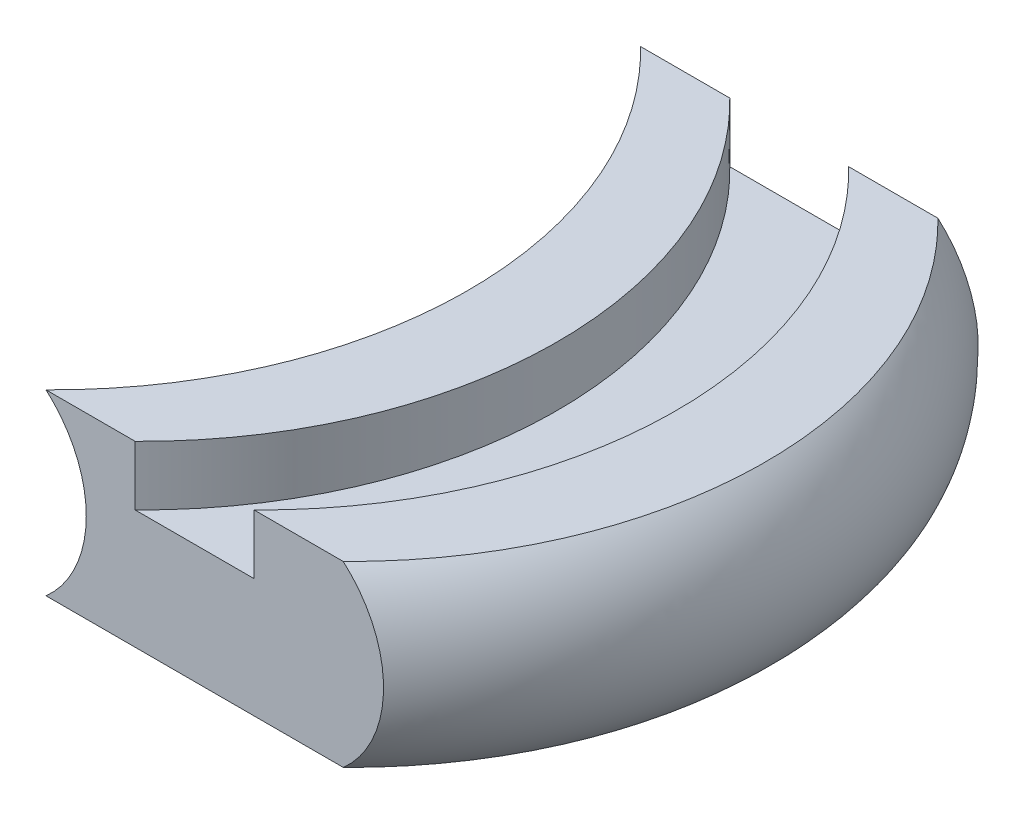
ISO-10303-21;
HEADER;
FILE_DESCRIPTION(('STEP AP214'),'2;1');
FILE_NAME('part.step','',(''),(''),'','','');
FILE_SCHEMA(('AUTOMOTIVE_DESIGN { 1 0 10303 214 1 1 1 1 }'));
ENDSEC;
DATA;
#1=APPLICATION_CONTEXT('core data for automotive mechanical design processes');
#2=APPLICATION_PROTOCOL_DEFINITION('international standard','automotive_design',2000,#1);
#3=PRODUCT_CONTEXT('',#1,'mechanical');
#4=PRODUCT('Part','Part','',(#3));
#5=PRODUCT_RELATED_PRODUCT_CATEGORY('part','',(#4));
#6=PRODUCT_DEFINITION_FORMATION('','',#4);
#7=PRODUCT_DEFINITION_CONTEXT('part definition',#1,'design');
#8=PRODUCT_DEFINITION('design','',#6,#7);
#9=PRODUCT_DEFINITION_SHAPE('','',#8);
#10=(LENGTH_UNIT() NAMED_UNIT(*) SI_UNIT(.MILLI.,.METRE.));
#11=(NAMED_UNIT(*) PLANE_ANGLE_UNIT() SI_UNIT($,.RADIAN.));
#12=(NAMED_UNIT(*) SI_UNIT($,.STERADIAN.) SOLID_ANGLE_UNIT());
#13=UNCERTAINTY_MEASURE_WITH_UNIT(LENGTH_MEASURE(1.E-05),#10,'distance_accuracy_value','');
#14=(GEOMETRIC_REPRESENTATION_CONTEXT(3) GLOBAL_UNCERTAINTY_ASSIGNED_CONTEXT((#13)) GLOBAL_UNIT_ASSIGNED_CONTEXT((#10,
#11,#12)) REPRESENTATION_CONTEXT('',''));
#15=CARTESIAN_POINT('',(0.,0.,0.));
#16=DIRECTION('',(0.,0.,1.));
#17=DIRECTION('',(1.,0.,0.));
#18=AXIS2_PLACEMENT_3D('',#15,#16,#17);
#19=CARTESIAN_POINT('',(-13.228756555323,15.,0.));
#20=DIRECTION('',(0.,0.,-1.));
#21=DIRECTION('',(-1.,0.,0.));
#22=AXIS2_PLACEMENT_3D('',#19,#20,#21);
#23=PLANE('',#22);
#24=CARTESIAN_POINT('',(-13.228756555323,15.,0.));
#25=DIRECTION('',(0.,0.,-1.));
#26=DIRECTION('',(-1.,0.,0.));
#27=AXIS2_PLACEMENT_3D('',#24,#25,#26);
#28=CIRCLE('',#27,20.);
#29=CARTESIAN_POINT('',(0.,30.,0.));
#30=VERTEX_POINT('',#29);
#31=CARTESIAN_POINT('',(0.,0.,0.));
#32=VERTEX_POINT('',#31);
#33=EDGE_CURVE('E503',#30,#32,#28,.T.);
#34=ORIENTED_EDGE('',*,*,#33,.F.);
#35=DIRECTION('',(-1.,0.,0.));
#36=VECTOR('',#35,1.);
#37=CARTESIAN_POINT('',(0.,30.,0.));
#38=LINE('',#37,#36);
#39=CARTESIAN_POINT('',(15.,30.,0.));
#40=VERTEX_POINT('',#39);
#41=EDGE_CURVE('E799',#40,#30,#38,.T.);
#42=ORIENTED_EDGE('',*,*,#41,.F.);
#43=DIRECTION('',(0.,1.,0.));
#44=VECTOR('',#43,1.);
#45=CARTESIAN_POINT('',(15.,30.,0.));
#46=LINE('',#45,#44);
#47=CARTESIAN_POINT('',(15.,20.,0.));
#48=VERTEX_POINT('',#47);
#49=EDGE_CURVE('E802',#48,#40,#46,.T.);
#50=ORIENTED_EDGE('',*,*,#49,.F.);
#51=DIRECTION('',(-1.,0.,0.));
#52=VECTOR('',#51,1.);
#53=CARTESIAN_POINT('',(15.,20.,0.));
#54=LINE('',#53,#52);
#55=CARTESIAN_POINT('',(35.,20.,0.));
#56=VERTEX_POINT('',#55);
#57=EDGE_CURVE('E750',#56,#48,#54,.T.);
#58=ORIENTED_EDGE('',*,*,#57,.F.);
#59=DIRECTION('',(0.,-1.,0.));
#60=VECTOR('',#59,1.);
#61=CARTESIAN_POINT('',(35.,20.,0.));
#62=LINE('',#61,#60);
#63=CARTESIAN_POINT('',(35.,30.,0.));
#64=VERTEX_POINT('',#63);
#65=EDGE_CURVE('E741',#64,#56,#62,.T.);
#66=ORIENTED_EDGE('',*,*,#65,.F.);
#67=DIRECTION('',(-1.,0.,0.));
#68=VECTOR('',#67,1.);
#69=CARTESIAN_POINT('',(35.,30.,0.));
#70=LINE('',#69,#68);
#71=CARTESIAN_POINT('',(50.,30.,0.));
#72=VERTEX_POINT('',#71);
#73=EDGE_CURVE('E485',#72,#64,#70,.T.);
#74=ORIENTED_EDGE('',*,*,#73,.F.);
#75=CARTESIAN_POINT('',(36.771243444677,15.,0.));
#76=DIRECTION('',(0.,0.,1.));
#77=DIRECTION('',(-1.,0.,0.));
#78=AXIS2_PLACEMENT_3D('',#75,#76,#77);
#79=CIRCLE('',#78,20.);
#80=CARTESIAN_POINT('',(50.,0.,0.));
#81=VERTEX_POINT('',#80);
#82=EDGE_CURVE('E477',#81,#72,#79,.T.);
#83=ORIENTED_EDGE('',*,*,#82,.F.);
#84=DIRECTION('',(1.,0.,0.));
#85=VECTOR('',#84,1.);
#86=CARTESIAN_POINT('',(50.,0.,0.));
#87=LINE('',#86,#85);
#88=CARTESIAN_POINT('',(47.499999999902,0.,0.));
#89=VERTEX_POINT('',#88);
#90=EDGE_CURVE('E482',#89,#81,#87,.T.);
#91=ORIENTED_EDGE('',*,*,#90,.F.);
#92=CARTESIAN_POINT('',(23.75,0.,0.));
#93=VERTEX_POINT('',#92);
#94=EDGE_CURVE('E501',#93,#89,#87,.T.);
#95=ORIENTED_EDGE('',*,*,#94,.F.);
#96=EDGE_CURVE('E492',#32,#93,#87,.T.);
#97=ORIENTED_EDGE('',*,*,#96,.F.);
#98=EDGE_LOOP('',(#34,#42,#50,#58,#66,#74,#83,#91,#95,#97));
#99=FACE_BOUND('',#98,.T.);
#100=ADVANCED_FACE('F396',(#99),#23,.T.);
#101=CARTESIAN_POINT('',(-13.228756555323,15.,100.));
#102=DIRECTION('',(0.,0.,1.));
#103=DIRECTION('',(1.,0.,0.));
#104=AXIS2_PLACEMENT_3D('',#101,#102,#103);
#105=PLANE('',#104);
#106=CARTESIAN_POINT('',(-13.228756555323,15.,100.));
#107=DIRECTION('',(0.,0.,-1.));
#108=DIRECTION('',(1.,0.,0.));
#109=AXIS2_PLACEMENT_3D('',#106,#107,#108);
#110=CIRCLE('',#109,20.);
#111=CARTESIAN_POINT('',(0.,30.,100.));
#112=VERTEX_POINT('',#111);
#113=CARTESIAN_POINT('',(6.77124344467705,15.,100.));
#114=VERTEX_POINT('',#113);
#115=EDGE_CURVE('E415',#112,#114,#110,.T.);
#116=ORIENTED_EDGE('',*,*,#115,.T.);
#117=CARTESIAN_POINT('',(0.,0.,100.));
#118=VERTEX_POINT('',#117);
#119=EDGE_CURVE('E511',#114,#118,#110,.T.);
#120=ORIENTED_EDGE('',*,*,#119,.T.);
#121=DIRECTION('',(1.,0.,0.));
#122=VECTOR('',#121,1.);
#123=CARTESIAN_POINT('',(0.,0.,100.));
#124=LINE('',#123,#122);
#125=CARTESIAN_POINT('',(47.5,0.,100.));
#126=VERTEX_POINT('',#125);
#127=EDGE_CURVE('E13',#118,#126,#124,.T.);
#128=ORIENTED_EDGE('',*,*,#127,.T.);
#129=CARTESIAN_POINT('',(50.,0.,100.));
#130=VERTEX_POINT('',#129);
#131=EDGE_CURVE('E407',#126,#130,#124,.T.);
#132=ORIENTED_EDGE('',*,*,#131,.T.);
#133=CARTESIAN_POINT('',(36.771243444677,15.,100.));
#134=DIRECTION('',(0.,0.,1.));
#135=DIRECTION('',(1.,0.,0.));
#136=AXIS2_PLACEMENT_3D('',#133,#134,#135);
#137=CIRCLE('',#136,20.);
#138=CARTESIAN_POINT('',(50.,30.,100.));
#139=VERTEX_POINT('',#138);
#140=EDGE_CURVE('E509',#130,#139,#137,.T.);
#141=ORIENTED_EDGE('',*,*,#140,.T.);
#142=DIRECTION('',(-1.,0.,0.));
#143=VECTOR('',#142,1.);
#144=CARTESIAN_POINT('',(50.,30.,100.));
#145=LINE('',#144,#143);
#146=CARTESIAN_POINT('',(35.,30.,100.));
#147=VERTEX_POINT('',#146);
#148=EDGE_CURVE('E822',#139,#147,#145,.T.);
#149=ORIENTED_EDGE('',*,*,#148,.T.);
#150=DIRECTION('',(0.,-1.,0.));
#151=VECTOR('',#150,1.);
#152=CARTESIAN_POINT('',(35.,30.,100.));
#153=LINE('',#152,#151);
#154=CARTESIAN_POINT('',(35.,20.,100.));
#155=VERTEX_POINT('',#154);
#156=EDGE_CURVE('E696',#147,#155,#153,.T.);
#157=ORIENTED_EDGE('',*,*,#156,.T.);
#158=DIRECTION('',(-1.,0.,0.));
#159=VECTOR('',#158,1.);
#160=CARTESIAN_POINT('',(35.,20.,100.));
#161=LINE('',#160,#159);
#162=CARTESIAN_POINT('',(15.,20.,100.));
#163=VERTEX_POINT('',#162);
#164=EDGE_CURVE('E756',#155,#163,#161,.T.);
#165=ORIENTED_EDGE('',*,*,#164,.T.);
#166=DIRECTION('',(0.,1.,0.));
#167=VECTOR('',#166,1.);
#168=CARTESIAN_POINT('',(15.,20.,100.));
#169=LINE('',#168,#167);
#170=CARTESIAN_POINT('',(15.,30.,100.));
#171=VERTEX_POINT('',#170);
#172=EDGE_CURVE('E663',#163,#171,#169,.T.);
#173=ORIENTED_EDGE('',*,*,#172,.T.);
#174=DIRECTION('',(-1.,0.,0.));
#175=VECTOR('',#174,1.);
#176=CARTESIAN_POINT('',(15.,30.,100.));
#177=LINE('',#176,#175);
#178=EDGE_CURVE('E790',#171,#112,#177,.T.);
#179=ORIENTED_EDGE('',*,*,#178,.T.);
#180=EDGE_LOOP('',(#116,#120,#128,#132,#141,#149,#157,#165,#173,#179));
#181=FACE_BOUND('',#180,.T.);
#182=ADVANCED_FACE('F548',(#181),#105,.T.);
#183=CARTESIAN_POINT('',(50.,30.,100.));
#184=CARTESIAN_POINT('',(58.9581480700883,30.,91.2228432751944));
#185=CARTESIAN_POINT('',(68.4858774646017,30.,74.8802615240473));
#186=CARTESIAN_POINT('',(71.851647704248,30.,50.));
#187=CARTESIAN_POINT('',(68.4858774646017,30.,25.1197384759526));
#188=CARTESIAN_POINT('',(58.9581480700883,30.,8.77715672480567));
#189=CARTESIAN_POINT('',(50.,30.,0.));
#190=CARTESIAN_POINT('',(51.0600775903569,29.0650994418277,100.));
#191=CARTESIAN_POINT('',(60.0182256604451,29.0650994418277,91.2228432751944));
#192=CARTESIAN_POINT('',(69.5459550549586,29.0650994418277,74.8802615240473));
#193=CARTESIAN_POINT('',(72.9117252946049,29.0650994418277,50.));
#194=CARTESIAN_POINT('',(69.5459550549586,29.0650994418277,25.1197384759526));
#195=CARTESIAN_POINT('',(60.0182256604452,29.0650994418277,8.77715672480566));
#196=CARTESIAN_POINT('',(51.0600775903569,29.0650994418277,0.));
#197=CARTESIAN_POINT('',(52.981305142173,26.9698133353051,100.));
#198=CARTESIAN_POINT('',(61.9394532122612,26.9698133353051,91.2228432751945));
#199=CARTESIAN_POINT('',(71.4671826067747,26.9698133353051,74.8802615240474));
#200=CARTESIAN_POINT('',(74.832952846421,26.9698133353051,50.0000000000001));
#201=CARTESIAN_POINT('',(71.4671826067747,26.9698133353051,25.1197384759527));
#202=CARTESIAN_POINT('',(61.9394532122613,26.969813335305,8.77715672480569));
#203=CARTESIAN_POINT('',(52.981305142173,26.969813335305,0.));
#204=CARTESIAN_POINT('',(55.137115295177,23.2906453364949,99.9999999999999));
#205=CARTESIAN_POINT('',(64.0952633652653,23.2906453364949,91.2228432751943));
#206=CARTESIAN_POINT('',(73.6229927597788,23.2906453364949,74.8802615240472));
#207=CARTESIAN_POINT('',(76.988762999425,23.2906453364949,50.));
#208=CARTESIAN_POINT('',(73.6229927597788,23.2906453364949,25.1197384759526));
#209=CARTESIAN_POINT('',(64.0952633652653,23.2906453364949,8.77715672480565));
#210=CARTESIAN_POINT('',(55.137115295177,23.2906453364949,0.));
#211=CARTESIAN_POINT('',(56.4705116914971,19.2402865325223,100.));
#212=CARTESIAN_POINT('',(65.4286597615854,19.2402865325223,91.2228432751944));
#213=CARTESIAN_POINT('',(74.9563891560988,19.2402865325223,74.8802615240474));
#214=CARTESIAN_POINT('',(78.3221593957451,19.2402865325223,50.0000000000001));
#215=CARTESIAN_POINT('',(74.9563891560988,19.2402865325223,25.1197384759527));
#216=CARTESIAN_POINT('',(65.4286597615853,19.2402865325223,8.77715672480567));
#217=CARTESIAN_POINT('',(56.470511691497,19.2402865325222,0.));
#218=CARTESIAN_POINT('',(56.9216918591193,15.,100.));
#219=CARTESIAN_POINT('',(65.8798399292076,15.,91.2228432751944));
#220=CARTESIAN_POINT('',(75.4075693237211,15.,74.8802615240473));
#221=CARTESIAN_POINT('',(78.7733395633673,15.,50.));
#222=CARTESIAN_POINT('',(75.4075693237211,15.,25.1197384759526));
#223=CARTESIAN_POINT('',(65.8798399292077,15.,8.77715672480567));
#224=CARTESIAN_POINT('',(56.9216918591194,15.,0.));
#225=CARTESIAN_POINT('',(56.470511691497,10.7597134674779,99.9999999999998));
#226=CARTESIAN_POINT('',(65.4286597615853,10.7597134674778,91.2228432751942));
#227=CARTESIAN_POINT('',(74.9563891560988,10.7597134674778,74.8802615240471));
#228=CARTESIAN_POINT('',(78.322159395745,10.7597134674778,49.9999999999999));
#229=CARTESIAN_POINT('',(74.9563891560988,10.7597134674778,25.1197384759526));
#230=CARTESIAN_POINT('',(65.4286597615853,10.7597134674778,8.77715672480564));
#231=CARTESIAN_POINT('',(56.470511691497,10.7597134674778,0.));
#232=CARTESIAN_POINT('',(55.1371152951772,6.70935466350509,100.));
#233=CARTESIAN_POINT('',(64.0952633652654,6.70935466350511,91.2228432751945));
#234=CARTESIAN_POINT('',(73.6229927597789,6.70935466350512,74.8802615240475));
#235=CARTESIAN_POINT('',(76.9887629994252,6.70935466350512,50.0000000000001));
#236=CARTESIAN_POINT('',(73.6229927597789,6.70935466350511,25.1197384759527));
#237=CARTESIAN_POINT('',(64.0952633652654,6.7093546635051,8.77715672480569));
#238=CARTESIAN_POINT('',(55.1371152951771,6.70935466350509,0.));
#239=CARTESIAN_POINT('',(52.9813051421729,3.03018666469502,99.9999999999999));
#240=CARTESIAN_POINT('',(61.9394532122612,3.03018666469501,91.2228432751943));
#241=CARTESIAN_POINT('',(71.4671826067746,3.030186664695,74.8802615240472));
#242=CARTESIAN_POINT('',(74.8329528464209,3.030186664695,50.));
#243=CARTESIAN_POINT('',(71.4671826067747,3.030186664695,25.1197384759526));
#244=CARTESIAN_POINT('',(61.9394532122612,3.03018666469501,8.77715672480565));
#245=CARTESIAN_POINT('',(52.9813051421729,3.03018666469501,0.));
#246=CARTESIAN_POINT('',(51.0600775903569,0.934900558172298,100.));
#247=CARTESIAN_POINT('',(60.0182256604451,0.934900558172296,91.2228432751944));
#248=CARTESIAN_POINT('',(69.5459550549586,0.934900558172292,74.8802615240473));
#249=CARTESIAN_POINT('',(72.9117252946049,0.934900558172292,50.));
#250=CARTESIAN_POINT('',(69.5459550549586,0.934900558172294,25.1197384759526));
#251=CARTESIAN_POINT('',(60.0182256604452,0.934900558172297,8.77715672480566));
#252=CARTESIAN_POINT('',(51.0600775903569,0.934900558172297,0.));
#253=CARTESIAN_POINT('',(50.,0.,100.));
#254=CARTESIAN_POINT('',(58.9581480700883,0.,91.2228432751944));
#255=CARTESIAN_POINT('',(68.4858774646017,0.,74.8802615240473));
#256=CARTESIAN_POINT('',(71.851647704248,0.,50.));
#257=CARTESIAN_POINT('',(68.4858774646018,0.,25.1197384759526));
#258=CARTESIAN_POINT('',(58.9581480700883,0.,8.77715672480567));
#259=CARTESIAN_POINT('',(50.,0.,0.));
#260=B_SPLINE_SURFACE_WITH_KNOTS('',3,3,((#183,#184,#185,#186,#187,#188,#189),(#190,#191,#192,
#193,#194,#195,#196),(#197,#198,#199,#200,#201,#202,#203),(#204,#205,#206,#207,#208,#209,#210),
(#211,#212,#213,#214,#215,#216,#217),(#218,#219,#220,#221,#222,#223,#224),(#225,#226,#227,#228,
#229,#230,#231),(#232,#233,#234,#235,#236,#237,#238),(#239,#240,#241,#242,#243,#244,#245),(#246,
#247,#248,#249,#250,#251,#252),(#253,#254,#255,#256,#257,#258,#259)),.UNSPECIFIED.,.F.,.F.,.F.,
(4,1,1,1,1,1,1,1,4),(4,1,1,1,4),(0.819412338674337,0.841985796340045,0.864559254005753,
0.88713271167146,0.909706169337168,0.932279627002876,0.954853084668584,0.977426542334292,1.),
(0.,0.333333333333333,0.5,0.666666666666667,1.),.UNSPECIFIED.);
#261=CARTESIAN_POINT('',(50.,0.,100.));
#262=CARTESIAN_POINT('',(58.9581480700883,0.,91.2228432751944));
#263=CARTESIAN_POINT('',(68.4858774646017,0.,74.8802615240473));
#264=CARTESIAN_POINT('',(71.851647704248,0.,50.));
#265=CARTESIAN_POINT('',(68.4858774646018,0.,25.1197384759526));
#266=CARTESIAN_POINT('',(58.9581480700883,0.,8.77715672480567));
#267=CARTESIAN_POINT('',(50.,0.,0.));
#268=B_SPLINE_CURVE_WITH_KNOTS('',3,(#261,#262,#263,#264,#265,#266,#267),.UNSPECIFIED.,.F.,.F.,
(4,1,1,1,4),(0.,0.333333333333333,0.5,0.666666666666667,1.),.UNSPECIFIED.);
#269=EDGE_CURVE('E500',#130,#81,#268,.T.);
#270=CARTESIAN_POINT('',(50.,30.,100.));
#271=CARTESIAN_POINT('',(58.9581480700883,30.,91.2228432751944));
#272=CARTESIAN_POINT('',(68.4858774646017,30.,74.8802615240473));
#273=CARTESIAN_POINT('',(71.851647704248,30.,50.));
#274=CARTESIAN_POINT('',(68.4858774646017,30.,25.1197384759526));
#275=CARTESIAN_POINT('',(58.9581480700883,30.,8.77715672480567));
#276=CARTESIAN_POINT('',(50.,30.,0.));
#277=B_SPLINE_CURVE_WITH_KNOTS('',3,(#270,#271,#272,#273,#274,#275,#276),.UNSPECIFIED.,.F.,.F.,
(4,1,1,1,4),(0.,0.333333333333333,0.5,0.666666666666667,1.),.UNSPECIFIED.);
#278=EDGE_CURVE('E512',#139,#72,#277,.T.);
#279=ORIENTED_EDGE('',*,*,#140,.F.);
#280=ORIENTED_EDGE('',*,*,#269,.T.);
#281=ORIENTED_EDGE('',*,*,#82,.T.);
#282=ORIENTED_EDGE('',*,*,#278,.F.);
#283=EDGE_LOOP('',(#279,#280,#281,#282));
#284=FACE_BOUND('',#283,.T.);
#285=ADVANCED_FACE('F508',(#284),#260,.T.);
#286=CARTESIAN_POINT('',(35.,30.,100.));
#287=DIRECTION('',(0.,1.,0.));
#288=DIRECTION('',(1.,0.,0.));
#289=AXIS2_PLACEMENT_3D('',#286,#287,#288);
#290=PLANE('',#289);
#291=ORIENTED_EDGE('',*,*,#148,.F.);
#292=ORIENTED_EDGE('',*,*,#278,.T.);
#293=ORIENTED_EDGE('',*,*,#73,.T.);
#294=CARTESIAN_POINT('',(35.,30.,100.));
#295=CARTESIAN_POINT('',(43.9581480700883,30.,91.2228432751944));
#296=CARTESIAN_POINT('',(53.4858774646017,30.,74.8802615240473));
#297=CARTESIAN_POINT('',(56.851647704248,30.,50.));
#298=CARTESIAN_POINT('',(53.4858774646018,30.,25.1197384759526));
#299=CARTESIAN_POINT('',(43.9581480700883,30.,8.77715672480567));
#300=CARTESIAN_POINT('',(35.,30.,0.));
#301=B_SPLINE_CURVE_WITH_KNOTS('',3,(#294,#295,#296,#297,#298,#299,#300),.UNSPECIFIED.,.F.,.F.,
(4,1,1,1,4),(0.,0.333333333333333,0.5,0.666666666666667,1.),.UNSPECIFIED.);
#302=EDGE_CURVE('E515',#147,#64,#301,.T.);
#303=ORIENTED_EDGE('',*,*,#302,.F.);
#304=EDGE_LOOP('',(#291,#292,#293,#303));
#305=FACE_BOUND('',#304,.T.);
#306=ADVANCED_FACE('F713',(#305),#290,.T.);
#307=CARTESIAN_POINT('',(35.,20.,100.));
#308=CARTESIAN_POINT('',(43.9581480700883,20.,91.2228432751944));
#309=CARTESIAN_POINT('',(53.4858774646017,20.,74.8802615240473));
#310=CARTESIAN_POINT('',(56.851647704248,20.,50.));
#311=CARTESIAN_POINT('',(53.4858774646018,20.,25.1197384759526));
#312=CARTESIAN_POINT('',(43.9581480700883,20.,8.77715672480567));
#313=CARTESIAN_POINT('',(35.,20.,0.));
#314=CARTESIAN_POINT('',(35.,20.8333333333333,100.));
#315=CARTESIAN_POINT('',(43.9581480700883,20.8333333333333,91.2228432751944));
#316=CARTESIAN_POINT('',(53.4858774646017,20.8333333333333,74.8802615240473));
#317=CARTESIAN_POINT('',(56.851647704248,20.8333333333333,50.));
#318=CARTESIAN_POINT('',(53.4858774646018,20.8333333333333,25.1197384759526));
#319=CARTESIAN_POINT('',(43.9581480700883,20.8333333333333,8.77715672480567));
#320=CARTESIAN_POINT('',(35.,20.8333333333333,0.));
#321=CARTESIAN_POINT('',(35.,22.5,99.9999999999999));
#322=CARTESIAN_POINT('',(43.9581480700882,22.5,91.2228432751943));
#323=CARTESIAN_POINT('',(53.4858774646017,22.5,74.8802615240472));
#324=CARTESIAN_POINT('',(56.851647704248,22.5,50.));
#325=CARTESIAN_POINT('',(53.4858774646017,22.5,25.1197384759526));
#326=CARTESIAN_POINT('',(43.9581480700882,22.5,8.77715672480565));
#327=CARTESIAN_POINT('',(35.,22.5,0.));
#328=CARTESIAN_POINT('',(35.0000000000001,25.,100.));
#329=CARTESIAN_POINT('',(43.9581480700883,25.,91.2228432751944));
#330=CARTESIAN_POINT('',(53.4858774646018,25.,74.8802615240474));
#331=CARTESIAN_POINT('',(56.8516477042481,25.,50.0000000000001));
#332=CARTESIAN_POINT('',(53.4858774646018,25.,25.1197384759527));
#333=CARTESIAN_POINT('',(43.9581480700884,25.,8.77715672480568));
#334=CARTESIAN_POINT('',(35.0000000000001,25.,0.));
#335=CARTESIAN_POINT('',(35.,27.5,100.));
#336=CARTESIAN_POINT('',(43.9581480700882,27.5,91.2228432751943));
#337=CARTESIAN_POINT('',(53.4858774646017,27.5,74.8802615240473));
#338=CARTESIAN_POINT('',(56.851647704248,27.5,50.));
#339=CARTESIAN_POINT('',(53.4858774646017,27.5,25.1197384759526));
#340=CARTESIAN_POINT('',(43.9581480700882,27.5,8.77715672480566));
#341=CARTESIAN_POINT('',(35.,27.5,0.));
#342=CARTESIAN_POINT('',(35.,29.1666666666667,100.));
#343=CARTESIAN_POINT('',(43.9581480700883,29.1666666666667,91.2228432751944));
#344=CARTESIAN_POINT('',(53.4858774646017,29.1666666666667,74.8802615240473));
#345=CARTESIAN_POINT('',(56.851647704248,29.1666666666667,50.));
#346=CARTESIAN_POINT('',(53.4858774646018,29.1666666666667,25.1197384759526));
#347=CARTESIAN_POINT('',(43.9581480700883,29.1666666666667,8.77715672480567));
#348=CARTESIAN_POINT('',(35.,29.1666666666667,0.));
#349=CARTESIAN_POINT('',(35.,30.,100.));
#350=CARTESIAN_POINT('',(43.9581480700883,30.,91.2228432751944));
#351=CARTESIAN_POINT('',(53.4858774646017,30.,74.8802615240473));
#352=CARTESIAN_POINT('',(56.851647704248,30.,50.));
#353=CARTESIAN_POINT('',(53.4858774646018,30.,25.1197384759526));
#354=CARTESIAN_POINT('',(43.9581480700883,30.,8.77715672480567));
#355=CARTESIAN_POINT('',(35.,30.,0.));
#356=B_SPLINE_SURFACE_WITH_KNOTS('',3,3,((#307,#308,#309,#310,#311,#312,#313),(#314,#315,#316,
#317,#318,#319,#320),(#321,#322,#323,#324,#325,#326,#327),(#328,#329,#330,#331,#332,#333,#334),
(#335,#336,#337,#338,#339,#340,#341),(#342,#343,#344,#345,#346,#347,#348),(#349,#350,#351,#352,
#353,#354,#355)),.UNSPECIFIED.,.F.,.F.,.F.,(4,1,1,1,4),(4,1,1,1,4),(0.686323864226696,
0.69963271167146,0.712941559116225,0.726250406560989,0.739559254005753),(0.,0.333333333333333,
0.5,0.666666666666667,1.),.UNSPECIFIED.);
#357=CARTESIAN_POINT('',(35.,20.,100.));
#358=CARTESIAN_POINT('',(43.9581480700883,20.,91.2228432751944));
#359=CARTESIAN_POINT('',(53.4858774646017,20.,74.8802615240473));
#360=CARTESIAN_POINT('',(56.851647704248,20.,50.));
#361=CARTESIAN_POINT('',(53.4858774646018,20.,25.1197384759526));
#362=CARTESIAN_POINT('',(43.9581480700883,20.,8.77715672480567));
#363=CARTESIAN_POINT('',(35.,20.,0.));
#364=B_SPLINE_CURVE_WITH_KNOTS('',3,(#357,#358,#359,#360,#361,#362,#363),.UNSPECIFIED.,.F.,.F.,
(4,1,1,1,4),(0.,0.333333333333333,0.5,0.666666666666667,1.),.UNSPECIFIED.);
#365=EDGE_CURVE('E674',#155,#56,#364,.T.);
#366=ORIENTED_EDGE('',*,*,#156,.F.);
#367=ORIENTED_EDGE('',*,*,#302,.T.);
#368=ORIENTED_EDGE('',*,*,#65,.T.);
#369=ORIENTED_EDGE('',*,*,#365,.F.);
#370=EDGE_LOOP('',(#366,#367,#368,#369));
#371=FACE_BOUND('',#370,.T.);
#372=ADVANCED_FACE('F702',(#371),#356,.T.);
#373=CARTESIAN_POINT('',(15.,20.,100.));
#374=DIRECTION('',(0.,1.,0.));
#375=DIRECTION('',(1.,0.,0.));
#376=AXIS2_PLACEMENT_3D('',#373,#374,#375);
#377=PLANE('',#376);
#378=ORIENTED_EDGE('',*,*,#164,.F.);
#379=ORIENTED_EDGE('',*,*,#365,.T.);
#380=ORIENTED_EDGE('',*,*,#57,.T.);
#381=CARTESIAN_POINT('',(15.,20.,100.));
#382=CARTESIAN_POINT('',(23.9581480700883,20.,91.2228432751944));
#383=CARTESIAN_POINT('',(33.4858774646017,20.,74.8802615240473));
#384=CARTESIAN_POINT('',(36.851647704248,20.,50.));
#385=CARTESIAN_POINT('',(33.4858774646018,20.,25.1197384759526));
#386=CARTESIAN_POINT('',(23.9581480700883,20.,8.77715672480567));
#387=CARTESIAN_POINT('',(15.,20.,0.));
#388=B_SPLINE_CURVE_WITH_KNOTS('',3,(#381,#382,#383,#384,#385,#386,#387),.UNSPECIFIED.,.F.,.F.,
(4,1,1,1,4),(0.,0.333333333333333,0.5,0.666666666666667,1.),.UNSPECIFIED.);
#389=EDGE_CURVE('E650',#163,#48,#388,.T.);
#390=ORIENTED_EDGE('',*,*,#389,.F.);
#391=EDGE_LOOP('',(#378,#379,#380,#390));
#392=FACE_BOUND('',#391,.T.);
#393=ADVANCED_FACE('F712',(#392),#377,.T.);
#394=CARTESIAN_POINT('',(15.,30.,100.));
#395=CARTESIAN_POINT('',(23.9581480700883,30.,91.2228432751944));
#396=CARTESIAN_POINT('',(33.4858774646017,30.,74.8802615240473));
#397=CARTESIAN_POINT('',(36.851647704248,30.,50.));
#398=CARTESIAN_POINT('',(33.4858774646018,30.,25.1197384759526));
#399=CARTESIAN_POINT('',(23.9581480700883,30.,8.77715672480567));
#400=CARTESIAN_POINT('',(15.,30.,0.));
#401=CARTESIAN_POINT('',(15.,29.1666666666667,100.));
#402=CARTESIAN_POINT('',(23.9581480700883,29.1666666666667,91.2228432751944));
#403=CARTESIAN_POINT('',(33.4858774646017,29.1666666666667,74.8802615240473));
#404=CARTESIAN_POINT('',(36.851647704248,29.1666666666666,50.));
#405=CARTESIAN_POINT('',(33.4858774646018,29.1666666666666,25.1197384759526));
#406=CARTESIAN_POINT('',(23.9581480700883,29.1666666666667,8.77715672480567));
#407=CARTESIAN_POINT('',(15.,29.1666666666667,0.));
#408=CARTESIAN_POINT('',(15.,27.5,100.));
#409=CARTESIAN_POINT('',(23.9581480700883,27.5,91.2228432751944));
#410=CARTESIAN_POINT('',(33.4858774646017,27.5,74.8802615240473));
#411=CARTESIAN_POINT('',(36.851647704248,27.5,50.));
#412=CARTESIAN_POINT('',(33.4858774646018,27.5,25.1197384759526));
#413=CARTESIAN_POINT('',(23.9581480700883,27.5,8.77715672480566));
#414=CARTESIAN_POINT('',(15.,27.5,0.));
#415=CARTESIAN_POINT('',(15.,25.,100.));
#416=CARTESIAN_POINT('',(23.9581480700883,25.,91.2228432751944));
#417=CARTESIAN_POINT('',(33.4858774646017,25.,74.8802615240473));
#418=CARTESIAN_POINT('',(36.851647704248,25.,50.));
#419=CARTESIAN_POINT('',(33.4858774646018,25.,25.1197384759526));
#420=CARTESIAN_POINT('',(23.9581480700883,25.,8.77715672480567));
#421=CARTESIAN_POINT('',(15.,25.,0.));
#422=CARTESIAN_POINT('',(15.,22.5,100.));
#423=CARTESIAN_POINT('',(23.9581480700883,22.5,91.2228432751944));
#424=CARTESIAN_POINT('',(33.4858774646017,22.5,74.8802615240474));
#425=CARTESIAN_POINT('',(36.851647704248,22.5,50.));
#426=CARTESIAN_POINT('',(33.4858774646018,22.5,25.1197384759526));
#427=CARTESIAN_POINT('',(23.9581480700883,22.5,8.77715672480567));
#428=CARTESIAN_POINT('',(15.,22.5,0.));
#429=CARTESIAN_POINT('',(15.,20.8333333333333,100.));
#430=CARTESIAN_POINT('',(23.9581480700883,20.8333333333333,91.2228432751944));
#431=CARTESIAN_POINT('',(33.4858774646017,20.8333333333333,74.8802615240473));
#432=CARTESIAN_POINT('',(36.851647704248,20.8333333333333,50.));
#433=CARTESIAN_POINT('',(33.4858774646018,20.8333333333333,25.1197384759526));
#434=CARTESIAN_POINT('',(23.9581480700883,20.8333333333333,8.77715672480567));
#435=CARTESIAN_POINT('',(15.,20.8333333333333,0.));
#436=CARTESIAN_POINT('',(15.,20.,100.));
#437=CARTESIAN_POINT('',(23.9581480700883,20.,91.2228432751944));
#438=CARTESIAN_POINT('',(33.4858774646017,20.,74.8802615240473));
#439=CARTESIAN_POINT('',(36.851647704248,20.,50.));
#440=CARTESIAN_POINT('',(33.4858774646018,20.,25.1197384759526));
#441=CARTESIAN_POINT('',(23.9581480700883,20.,8.77715672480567));
#442=CARTESIAN_POINT('',(15.,20.,0.));
#443=B_SPLINE_SURFACE_WITH_KNOTS('',3,3,((#394,#395,#396,#397,#398,#399,#400),(#401,#402,#403,
#404,#405,#406,#407),(#408,#409,#410,#411,#412,#413,#414),(#415,#416,#417,#418,#419,#420,#421),
(#422,#423,#424,#425,#426,#427,#428),(#429,#430,#431,#432,#433,#434,#435),(#436,#437,#438,#439,
#440,#441,#442)),.UNSPECIFIED.,.F.,.F.,.F.,(4,1,1,1,4),(4,1,1,1,4),(0.526617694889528,
0.539926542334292,0.553235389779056,0.56654423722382,0.579853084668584),(0.,0.333333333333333,
0.5,0.666666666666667,1.),.UNSPECIFIED.);
#444=CARTESIAN_POINT('',(15.,30.,100.));
#445=CARTESIAN_POINT('',(23.9581480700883,30.,91.2228432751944));
#446=CARTESIAN_POINT('',(33.4858774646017,30.,74.8802615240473));
#447=CARTESIAN_POINT('',(36.851647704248,30.,50.));
#448=CARTESIAN_POINT('',(33.4858774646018,30.,25.1197384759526));
#449=CARTESIAN_POINT('',(23.9581480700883,30.,8.77715672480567));
#450=CARTESIAN_POINT('',(15.,30.,0.));
#451=B_SPLINE_CURVE_WITH_KNOTS('',3,(#444,#445,#446,#447,#448,#449,#450),.UNSPECIFIED.,.F.,.F.,
(4,1,1,1,4),(0.,0.333333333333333,0.5,0.666666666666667,1.),.UNSPECIFIED.);
#452=EDGE_CURVE('E639',#171,#40,#451,.T.);
#453=ORIENTED_EDGE('',*,*,#172,.F.);
#454=ORIENTED_EDGE('',*,*,#389,.T.);
#455=ORIENTED_EDGE('',*,*,#49,.T.);
#456=ORIENTED_EDGE('',*,*,#452,.F.);
#457=EDGE_LOOP('',(#453,#454,#455,#456));
#458=FACE_BOUND('',#457,.T.);
#459=ADVANCED_FACE('F615',(#458),#443,.T.);
#460=CARTESIAN_POINT('',(0.,30.,100.));
#461=DIRECTION('',(0.,1.,0.));
#462=DIRECTION('',(1.,0.,0.));
#463=AXIS2_PLACEMENT_3D('',#460,#461,#462);
#464=PLANE('',#463);
#465=ORIENTED_EDGE('',*,*,#178,.F.);
#466=ORIENTED_EDGE('',*,*,#452,.T.);
#467=ORIENTED_EDGE('',*,*,#41,.T.);
#468=CARTESIAN_POINT('',(0.,30.,100.));
#469=CARTESIAN_POINT('',(8.95814807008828,30.,91.2228432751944));
#470=CARTESIAN_POINT('',(18.4858774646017,30.,74.8802615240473));
#471=CARTESIAN_POINT('',(21.851647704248,30.,50.));
#472=CARTESIAN_POINT('',(18.4858774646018,30.,25.1197384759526));
#473=CARTESIAN_POINT('',(8.95814807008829,30.,8.77715672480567));
#474=CARTESIAN_POINT('',(0.,30.,0.));
#475=B_SPLINE_CURVE_WITH_KNOTS('',3,(#468,#469,#470,#471,#472,#473,#474),.UNSPECIFIED.,.F.,.F.,
(4,1,1,1,4),(0.,0.333333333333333,0.5,0.666666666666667,1.),.UNSPECIFIED.);
#476=EDGE_CURVE('E632',#112,#30,#475,.T.);
#477=ORIENTED_EDGE('',*,*,#476,.F.);
#478=EDGE_LOOP('',(#465,#466,#467,#477));
#479=FACE_BOUND('',#478,.T.);
#480=ADVANCED_FACE('F398',(#479),#464,.T.);
#481=CARTESIAN_POINT('',(6.77124344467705,15.,100.));
#482=CARTESIAN_POINT('',(15.7293915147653,15.1494667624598,91.2228432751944));
#483=CARTESIAN_POINT('',(24.6928506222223,14.0115668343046,74.8802615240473));
#484=CARTESIAN_POINT('',(26.5539000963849,10.6782335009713,50.));
#485=CARTESIAN_POINT('',(21.3072288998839,6.43683345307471,25.1197384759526));
#486=CARTESIAN_POINT('',(10.0866886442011,2.57473338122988,8.77715672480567));
#487=CARTESIAN_POINT('',(0.,0.,0.));
#488=CARTESIAN_POINT('',(6.77124344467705,15.7067183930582,100.));
#489=CARTESIAN_POINT('',(15.7293915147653,15.8448664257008,91.2228432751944));
#490=CARTESIAN_POINT('',(24.7811904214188,14.7174926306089,74.8802615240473));
#491=CARTESIAN_POINT('',(26.8778126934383,11.4348664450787,50.));
#492=CARTESIAN_POINT('',(21.9256074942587,7.26250969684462,25.1197384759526));
#493=CARTESIAN_POINT('',(10.9700866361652,3.46594421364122,8.77715672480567));
#494=CARTESIAN_POINT('',(1.06007759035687,0.934900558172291,0.));
#495=CARTESIAN_POINT('',(6.69607171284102,17.1201463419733,100.));
#496=CARTESIAN_POINT('',(15.6542197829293,17.2356569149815,91.2228432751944));
#497=CARTESIAN_POINT('',(24.8723852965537,16.1481265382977,74.8802615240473));
#498=CARTESIAN_POINT('',(27.4126518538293,13.0170243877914,50.));
#499=CARTESIAN_POINT('',(23.0150020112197,9.04539141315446,25.1197384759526));
#500=CARTESIAN_POINT('',(12.5585809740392,5.43626856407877,8.77715672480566));
#501=CARTESIAN_POINT('',(2.98130514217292,3.03018666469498,0.));
#502=CARTESIAN_POINT('',(6.36025270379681,19.2165389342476,99.9999999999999));
#503=CARTESIAN_POINT('',(15.3184007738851,19.3024978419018,91.2228432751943));
#504=CARTESIAN_POINT('',(24.7442020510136,18.3247016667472,74.8802615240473));
#505=CARTESIAN_POINT('',(27.8381639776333,15.54532738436,50.));
#506=CARTESIAN_POINT('',(24.1326333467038,12.0281300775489,25.1197384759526));
#507=CARTESIAN_POINT('',(14.2991196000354,8.8368648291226,8.77715672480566));
#508=CARTESIAN_POINT('',(5.13711529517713,6.70935466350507,0.));
#509=CARTESIAN_POINT('',(5.80382606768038,21.265459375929,100.));
#510=CARTESIAN_POINT('',(14.7619741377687,21.3255581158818,91.2228432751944));
#511=CARTESIAN_POINT('',(24.3452606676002,20.4951533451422,74.8802615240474));
#512=CARTESIAN_POINT('',(27.8591832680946,18.1605431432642,50.0000000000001));
#513=CARTESIAN_POINT('',(24.6786034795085,15.2122310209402,25.1197384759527));
#514=CARTESIAN_POINT('',(15.3175454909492,12.5407204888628,8.77715672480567));
#515=CARTESIAN_POINT('',(6.47051169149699,10.7597134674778,0.));
#516=CARTESIAN_POINT('',(5.03430634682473,23.2442429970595,100.));
#517=CARTESIAN_POINT('',(13.992454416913,23.2827906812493,91.2228432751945));
#518=CARTESIAN_POINT('',(23.677465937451,22.6246811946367,74.8802615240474));
#519=CARTESIAN_POINT('',(27.4626551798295,20.7926271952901,50.0000000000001));
#520=CARTESIAN_POINT('',(24.6211586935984,18.483285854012,25.1197384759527));
#521=CARTESIAN_POINT('',(15.5652756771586,16.3933143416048,8.77715672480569));
#522=CARTESIAN_POINT('',(6.92169185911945,15.,0.));
#523=CARTESIAN_POINT('',(4.05920808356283,25.130225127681,100.));
#524=CARTESIAN_POINT('',(13.0173561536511,25.1516858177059,91.2228432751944));
#525=CARTESIAN_POINT('',(22.7460275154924,24.6769531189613,74.8802615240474));
#526=CARTESIAN_POINT('',(26.6476430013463,23.3680778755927,50.));
#527=CARTESIAN_POINT('',(23.9516793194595,21.7212534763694,25.1197384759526));
#528=CARTESIAN_POINT('',(15.0267758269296,20.2326733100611,8.77715672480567));
#529=CARTESIAN_POINT('',(6.47051169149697,19.2402865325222,0.));
#530=CARTESIAN_POINT('',(2.89055937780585,26.9027785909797,99.9999999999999));
#531=CARTESIAN_POINT('',(11.8487074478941,26.911973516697,91.2228432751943));
#532=CARTESIAN_POINT('',(21.5636498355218,26.6178586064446,74.8802615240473));
#533=CARTESIAN_POINT('',(25.4286547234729,25.8151623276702,50.));
#534=CARTESIAN_POINT('',(22.6869277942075,24.8071945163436,25.1197384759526));
#535=CARTESIAN_POINT('',(13.7208373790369,23.8972650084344,8.77715672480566));
#536=CARTESIAN_POINT('',(5.13711529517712,23.2906453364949,0.));
#537=CARTESIAN_POINT('',(1.54038832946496,28.5412762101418,100.));
#538=CARTESIAN_POINT('',(10.4985363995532,28.5427193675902,91.2228432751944));
#539=CARTESIAN_POINT('',(20.1463421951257,28.4128464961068,74.8802615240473));
#540=CARTESIAN_POINT('',(23.8323161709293,28.0636325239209,50.));
#541=CARTESIAN_POINT('',(20.8668006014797,27.6263934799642,25.1197384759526));
#542=CARTESIAN_POINT('',(11.6993004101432,27.2324453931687,8.77715672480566));
#543=CARTESIAN_POINT('',(2.98130514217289,26.969813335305,0.));
#544=CARTESIAN_POINT('',(0.53003879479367,29.5325497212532,100.));
#545=CARTESIAN_POINT('',(9.48818686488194,29.533030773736,91.2228432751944));
#546=CARTESIAN_POINT('',(19.0600861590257,29.494437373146,74.8802615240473));
#547=CARTESIAN_POINT('',(22.543642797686,29.3905595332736,50.));
#548=CARTESIAN_POINT('',(19.3251055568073,29.2604717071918,25.1197384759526));
#549=CARTESIAN_POINT('',(9.92988586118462,29.1432483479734,8.77715672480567));
#550=CARTESIAN_POINT('',(1.06007759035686,29.0650994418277,0.));
#551=CARTESIAN_POINT('',(0.,30.,100.));
#552=CARTESIAN_POINT('',(8.95814807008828,30.,91.2228432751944));
#553=CARTESIAN_POINT('',(18.4858774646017,30.,74.8802615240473));
#554=CARTESIAN_POINT('',(21.851647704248,30.,50.));
#555=CARTESIAN_POINT('',(18.4858774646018,30.,25.1197384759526));
#556=CARTESIAN_POINT('',(8.95814807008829,30.,8.77715672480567));
#557=CARTESIAN_POINT('',(0.,30.,0.));
#558=B_SPLINE_SURFACE_WITH_KNOTS('',3,3,((#481,#482,#483,#484,#485,#486,#487),(#488,#489,#490,
#491,#492,#493,#494),(#495,#496,#497,#498,#499,#500,#501),(#502,#503,#504,#505,#506,#507,#508),
(#509,#510,#511,#512,#513,#514,#515),(#516,#517,#518,#519,#520,#521,#522),(#523,#524,#525,#526,
#527,#528,#529),(#530,#531,#532,#533,#534,#535,#536),(#537,#538,#539,#540,#541,#542,#543),(#544,
#545,#546,#547,#548,#549,#550),(#551,#552,#553,#554,#555,#556,#557)),.UNSPECIFIED.,.F.,.F.,.F.,
(4,1,1,1,1,1,1,1,4),(4,1,1,1,4),(0.311323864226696,0.328253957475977,0.345184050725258,
0.362114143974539,0.37904423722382,0.395974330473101,0.412904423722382,0.429834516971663,
0.446764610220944),(0.,0.333333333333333,0.5,0.666666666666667,1.),.UNSPECIFIED.);
#559=CARTESIAN_POINT('',(6.77124344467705,15.,100.));
#560=CARTESIAN_POINT('',(15.7293915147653,15.1494667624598,91.2228432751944));
#561=CARTESIAN_POINT('',(24.6928506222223,14.0115668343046,74.8802615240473));
#562=CARTESIAN_POINT('',(26.5539000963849,10.6782335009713,50.));
#563=CARTESIAN_POINT('',(21.3072288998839,6.43683345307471,25.1197384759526));
#564=CARTESIAN_POINT('',(10.0866886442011,2.57473338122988,8.77715672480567));
#565=CARTESIAN_POINT('',(0.,0.,0.));
#566=B_SPLINE_CURVE_WITH_KNOTS('',3,(#559,#560,#561,#562,#563,#564,#565),.UNSPECIFIED.,.F.,.F.,
(4,1,1,1,4),(0.,0.333333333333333,0.5,0.666666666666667,1.),.UNSPECIFIED.);
#567=EDGE_CURVE('E640',#114,#32,#566,.T.);
#568=ORIENTED_EDGE('',*,*,#115,.F.);
#569=ORIENTED_EDGE('',*,*,#476,.T.);
#570=ORIENTED_EDGE('',*,*,#33,.T.);
#571=ORIENTED_EDGE('',*,*,#567,.F.);
#572=EDGE_LOOP('',(#568,#569,#570,#571));
#573=FACE_BOUND('',#572,.T.);
#574=ADVANCED_FACE('F604',(#573),#558,.T.);
#575=CARTESIAN_POINT('',(0.,0.,100.));
#576=CARTESIAN_POINT('',(8.95814807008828,0.309069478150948,91.2228432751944));
#577=CARTESIAN_POINT('',(20.4650441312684,0.54087158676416,74.8802615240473));
#578=CARTESIAN_POINT('',(29.1085921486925,0.54087158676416,50.));
#579=CARTESIAN_POINT('',(32.3400441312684,0.386336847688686,25.1197384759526));
#580=CARTESIAN_POINT('',(28.7498147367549,0.154534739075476,8.77715672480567));
#581=CARTESIAN_POINT('',(23.75,0.,0.));
#582=CARTESIAN_POINT('',(1.06007758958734,0.934900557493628,100.));
#583=CARTESIAN_POINT('',(10.0182256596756,1.17642977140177,91.2228432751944));
#584=CARTESIAN_POINT('',(21.2718513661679,1.27966830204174,74.8802615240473));
#585=CARTESIAN_POINT('',(29.2400117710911,1.07191262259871,50.));
#586=CARTESIAN_POINT('',(31.6272292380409,0.691453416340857,25.1197384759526));
#587=CARTESIAN_POINT('',(27.2771887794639,0.276581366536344,8.77715672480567));
#588=CARTESIAN_POINT('',(21.7708333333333,0.,0.));
#589=CARTESIAN_POINT('',(2.98132054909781,3.03019348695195,100.));
#590=CARTESIAN_POINT('',(11.9394686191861,3.13664217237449,91.2228432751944));
#591=CARTESIAN_POINT('',(22.7031296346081,2.96396256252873,74.8802615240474));
#592=CARTESIAN_POINT('',(29.3647175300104,2.29058623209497,50.0000000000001));
#593=CARTESIAN_POINT('',(30.1187193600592,1.39564147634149,25.1197384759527));
#594=CARTESIAN_POINT('',(24.2987848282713,0.558256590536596,8.77715672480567));
#595=CARTESIAN_POINT('',(17.8125,0.,0.));
#596=CARTESIAN_POINT('',(5.13709561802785,6.70935625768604,100.));
#597=CARTESIAN_POINT('',(14.0952436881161,6.74767444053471,91.2228432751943));
#598=CARTESIAN_POINT('',(24.1844651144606,6.21730005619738,74.8802615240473));
#599=CARTESIAN_POINT('',(29.0475474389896,4.72633199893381,50.));
#600=CARTESIAN_POINT('',(27.5534173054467,2.84346283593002,25.1197384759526));
#601=CARTESIAN_POINT('',(19.7101640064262,1.13738513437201,8.77715672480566));
#602=CARTESIAN_POINT('',(11.875,0.,0.));
#603=CARTESIAN_POINT('',(6.47055651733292,10.759724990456,100.));
#604=CARTESIAN_POINT('',(15.4287045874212,10.8096660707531,91.2228432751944));
#605=CARTESIAN_POINT('',(24.9120126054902,9.95047813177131,74.8802615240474));
#606=CARTESIAN_POINT('',(28.1593258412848,7.5594281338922,50.0000000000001));
#607=CARTESIAN_POINT('',(24.6454843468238,4.54564509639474,25.1197384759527));
#608=CARTESIAN_POINT('',(14.9844908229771,1.8182580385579,8.77715672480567));
#609=CARTESIAN_POINT('',(5.9375,0.,0.));
#610=CARTESIAN_POINT('',(6.77124344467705,13.5865632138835,100.));
#611=CARTESIAN_POINT('',(15.7293915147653,13.7028547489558,91.2228432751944));
#612=CARTESIAN_POINT('',(24.8577811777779,12.657859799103,74.8802615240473));
#613=CARTESIAN_POINT('',(27.1586454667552,9.63862352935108,50.));
#614=CARTESIAN_POINT('',(22.4617427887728,5.80643242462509,25.1197384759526));
#615=CARTESIAN_POINT('',(11.7359941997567,2.32257296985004,8.77715672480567));
#616=CARTESIAN_POINT('',(1.97916666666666,0.,0.));
#617=CARTESIAN_POINT('',(6.77124344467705,15.,100.));
#618=CARTESIAN_POINT('',(15.7293915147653,15.1494667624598,91.2228432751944));
#619=CARTESIAN_POINT('',(24.6928506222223,14.0115668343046,74.8802615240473));
#620=CARTESIAN_POINT('',(26.5539000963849,10.6782335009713,50.));
#621=CARTESIAN_POINT('',(21.3072288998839,6.43683345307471,25.1197384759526));
#622=CARTESIAN_POINT('',(10.0866886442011,2.57473338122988,8.77715672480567));
#623=CARTESIAN_POINT('',(0.,0.,0.));
#624=B_SPLINE_SURFACE_WITH_KNOTS('',3,3,((#575,#576,#577,#578,#579,#580,#581),(#582,#583,#584,
#585,#586,#587,#588),(#589,#590,#591,#592,#593,#594,#595),(#596,#597,#598,#599,#600,#601,#602),
(#603,#604,#605,#606,#607,#608,#609),(#610,#611,#612,#613,#614,#615,#616),(#617,#618,#619,#620,
#621,#622,#623)),.UNSPECIFIED.,.F.,.F.,.F.,(4,1,1,1,4),(4,1,1,1,4),(0.202959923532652,
0.230050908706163,0.257141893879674,0.284232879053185,0.311323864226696),(0.,0.333333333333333,
0.5,0.666666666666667,1.),.UNSPECIFIED.);
#625=CARTESIAN_POINT('',(0.,0.,100.));
#626=CARTESIAN_POINT('',(8.95814807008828,0.309069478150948,91.2228432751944));
#627=CARTESIAN_POINT('',(20.4650441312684,0.54087158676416,74.8802615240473));
#628=CARTESIAN_POINT('',(29.1085921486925,0.54087158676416,50.));
#629=CARTESIAN_POINT('',(32.3400441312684,0.386336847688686,25.1197384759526));
#630=CARTESIAN_POINT('',(28.7498147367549,0.154534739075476,8.77715672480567));
#631=CARTESIAN_POINT('',(23.75,0.,0.));
#632=B_SPLINE_CURVE_WITH_KNOTS('',3,(#625,#626,#627,#628,#629,#630,#631),.UNSPECIFIED.,.F.,.F.,
(4,1,1,1,4),(0.,0.333333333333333,0.5,0.666666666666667,1.),.UNSPECIFIED.);
#633=EDGE_CURVE('E801',#118,#93,#632,.T.);
#634=ORIENTED_EDGE('',*,*,#119,.F.);
#635=ORIENTED_EDGE('',*,*,#567,.T.);
#636=ORIENTED_EDGE('',*,*,#96,.T.);
#637=ORIENTED_EDGE('',*,*,#633,.F.);
#638=EDGE_LOOP('',(#634,#635,#636,#637));
#639=FACE_BOUND('',#638,.T.);
#640=ADVANCED_FACE('F547',(#639),#624,.T.);
#641=CARTESIAN_POINT('',(50.,0.,100.));
#642=CARTESIAN_POINT('',(58.9581480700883,0.,91.2228432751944));
#643=CARTESIAN_POINT('',(68.4858774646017,0.,74.8802615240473));
#644=CARTESIAN_POINT('',(71.851647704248,0.,50.));
#645=CARTESIAN_POINT('',(68.4858774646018,0.,25.1197384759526));
#646=CARTESIAN_POINT('',(58.9581480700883,0.,8.77715672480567));
#647=CARTESIAN_POINT('',(50.,0.,0.));
#648=CARTESIAN_POINT('',(49.7916666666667,0.,100.));
#649=CARTESIAN_POINT('',(58.7498147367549,-5.95187329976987E-07,91.2228432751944));
#650=CARTESIAN_POINT('',(68.2775441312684,-1.04157782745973E-06,74.8802615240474));
#651=CARTESIAN_POINT('',(71.6433143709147,-1.04157783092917E-06,50.));
#652=CARTESIAN_POINT('',(68.2775441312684,-7.43984165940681E-07,25.1197384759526));
#653=CARTESIAN_POINT('',(58.7498147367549,-2.97593664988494E-07,8.77715672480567));
#654=CARTESIAN_POINT('',(49.7916666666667,0.,0.));
#655=CARTESIAN_POINT('',(49.39789552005,0.,100.));
#656=CARTESIAN_POINT('',(58.3560435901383,-1.78556198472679E-06,91.2228432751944));
#657=CARTESIAN_POINT('',(67.8773350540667,-3.12473347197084E-06,74.8802615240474));
#658=CARTESIAN_POINT('',(71.2259374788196,-3.12473347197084E-06,50.));
#659=CARTESIAN_POINT('',(67.8387074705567,-2.23195248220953E-06,25.1197384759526));
#660=CARTESIAN_POINT('',(58.2916642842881,-8.92780991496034E-07,8.77715672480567));
#661=CARTESIAN_POINT('',(49.3206403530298,0.,0.));
#662=CARTESIAN_POINT('',(48.8247473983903,0.,99.9999999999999));
#663=CARTESIAN_POINT('',(57.7828954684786,3.27785310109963E-05,91.2228432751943));
#664=CARTESIAN_POINT('',(67.2893087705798,5.73624292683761E-05,74.8802615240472));
#665=CARTESIAN_POINT('',(70.5982360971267,5.73624292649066E-05,50.));
#666=CARTESIAN_POINT('',(67.1614122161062,4.09731637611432E-05,25.1197384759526));
#667=CARTESIAN_POINT('',(57.5697345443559,1.63892655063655E-05,8.77715672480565));
#668=CARTESIAN_POINT('',(48.5689542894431,0.,0.));
#669=CARTESIAN_POINT('',(48.2234547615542,0.,100.));
#670=CARTESIAN_POINT('',(57.1816028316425,4.26637770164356E-05,91.2228432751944));
#671=CARTESIAN_POINT('',(66.6874588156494,7.4661609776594E-05,74.8802615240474));
#672=CARTESIAN_POINT('',(69.9948999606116,7.4661609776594E-05,50.0000000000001));
#673=CARTESIAN_POINT('',(66.5562183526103,5.33297212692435E-05,25.1197384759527));
#674=CARTESIAN_POINT('',(56.9628687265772,2.13318885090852E-05,8.77715672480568));
#675=CARTESIAN_POINT('',(47.9609738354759,0.,0.));
#676=CARTESIAN_POINT('',(47.7732240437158,0.,100.));
#677=CARTESIAN_POINT('',(56.7313721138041,-5.68727049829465E-06,91.2228432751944));
#678=CARTESIAN_POINT('',(66.2482863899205,-9.95272337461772E-06,74.8802615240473));
#679=CARTESIAN_POINT('',(69.5852163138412,-9.95272337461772E-06,50.));
#680=CARTESIAN_POINT('',(66.183395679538,-7.10908812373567E-06,25.1197384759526));
#681=CARTESIAN_POINT('',(56.6232209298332,-2.84363524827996E-06,8.77715672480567));
#682=CARTESIAN_POINT('',(47.6434426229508,0.,0.));
#683=CARTESIAN_POINT('',(43.6065573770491,0.,100.));
#684=CARTESIAN_POINT('',(52.5647054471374,8.10436046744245E-05,91.2228432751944));
#685=CARTESIAN_POINT('',(62.2465502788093,0.000141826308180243,74.8802615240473));
#686=CARTESIAN_POINT('',(66.0232950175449,0.000141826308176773,50.));
#687=CARTESIAN_POINT('',(63.1712429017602,0.000101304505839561,25.1197384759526));
#688=CARTESIAN_POINT('',(54.1058598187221,4.05218023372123E-05,8.77715672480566));
#689=CARTESIAN_POINT('',(45.4559426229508,0.,0.));
#690=CARTESIAN_POINT('',(35.4442051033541,0.,100.));
#691=CARTESIAN_POINT('',(44.4023531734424,0.012371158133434,91.2228432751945));
#692=CARTESIAN_POINT('',(54.4470479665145,0.0216495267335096,74.8802615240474));
#693=CARTESIAN_POINT('',(59.1913926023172,0.0216495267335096,50.0000000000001));
#694=CARTESIAN_POINT('',(57.5488403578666,0.0154639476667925,25.1197384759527));
#695=CARTESIAN_POINT('',(49.5720071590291,0.00618557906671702,8.77715672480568));
#696=CARTESIAN_POINT('',(41.6477898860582,0.,0.));
#697=CARTESIAN_POINT('',(22.7774137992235,0.,99.9999999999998));
#698=CARTESIAN_POINT('',(31.7355618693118,0.089303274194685,91.2228432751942));
#699=CARTESIAN_POINT('',(42.3793514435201,0.156280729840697,74.8802615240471));
#700=CARTESIAN_POINT('',(48.7212821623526,0.156280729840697,49.9999999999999));
#701=CARTESIAN_POINT('',(49.0757125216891,0.111629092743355,25.1197384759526));
#702=CARTESIAN_POINT('',(42.8961636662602,0.0446516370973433,8.77715672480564));
#703=CARTESIAN_POINT('',(36.1701359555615,0.,0.));
#704=CARTESIAN_POINT('',(10.6867541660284,0.,100.));
#705=CARTESIAN_POINT('',(19.6449022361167,0.214191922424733,91.2228432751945));
#706=CARTESIAN_POINT('',(30.822783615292,0.374835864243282,74.8802615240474));
#707=CARTESIAN_POINT('',(38.5889591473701,0.374835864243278,50.0000000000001));
#708=CARTESIAN_POINT('',(40.7236955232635,0.267739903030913,25.1197384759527));
#709=CARTESIAN_POINT('',(36.1464220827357,0.107095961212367,8.77715672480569));
#710=CARTESIAN_POINT('',(30.4885779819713,0.,0.));
#711=CARTESIAN_POINT('',(3.41849211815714,0.,100.));
#712=CARTESIAN_POINT('',(12.3766401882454,0.277443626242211,91.2228432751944));
#713=CARTESIAN_POINT('',(23.8085792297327,0.485526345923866,74.8802615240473));
#714=CARTESIAN_POINT('',(32.2522418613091,0.485526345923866,50.));
#715=CARTESIAN_POINT('',(35.2338371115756,0.346804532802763,25.1197384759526));
#716=CARTESIAN_POINT('',(31.4187366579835,0.138721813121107,8.77715672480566));
#717=CARTESIAN_POINT('',(26.2690078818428,0.,0.));
#718=CARTESIAN_POINT('',(0.,0.,100.));
#719=CARTESIAN_POINT('',(8.95814807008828,0.309069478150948,91.2228432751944));
#720=CARTESIAN_POINT('',(20.4650441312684,0.54087158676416,74.8802615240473));
#721=CARTESIAN_POINT('',(29.1085921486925,0.54087158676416,50.));
#722=CARTESIAN_POINT('',(32.3400441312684,0.386336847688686,25.1197384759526));
#723=CARTESIAN_POINT('',(28.7498147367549,0.154534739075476,8.77715672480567));
#724=CARTESIAN_POINT('',(23.75,0.,0.));
#725=B_SPLINE_SURFACE_WITH_KNOTS('',3,3,((#641,#642,#643,#644,#645,#646,#647),(#648,#649,#650,
#651,#652,#653,#654),(#655,#656,#657,#658,#659,#660,#661),(#662,#663,#664,#665,#666,#667,#668),
(#669,#670,#671,#672,#673,#674,#675),(#676,#677,#678,#679,#680,#681,#682),(#683,#684,#685,#686,
#687,#688,#689),(#690,#691,#692,#693,#694,#695,#696),(#697,#698,#699,#700,#701,#702,#703),(#704,
#705,#706,#707,#708,#709,#710),(#711,#712,#713,#714,#715,#716,#717),(#718,#719,#720,#721,#722,
#723,#724)),.UNSPECIFIED.,.F.,.F.,.F.,(4,1,1,1,2,1,1,1,4),(4,1,1,1,4),(0.,0.00332721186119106,
0.00665442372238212,0.00998163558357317,0.0133088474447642,0.0607216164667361,0.108134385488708,
0.15554715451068,0.202959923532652),(0.,0.333333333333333,0.5,0.666666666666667,1.),.UNSPECIFIED.);
#726=ORIENTED_EDGE('',*,*,#131,.F.);
#727=ORIENTED_EDGE('',*,*,#127,.F.);
#728=ORIENTED_EDGE('',*,*,#633,.T.);
#729=ORIENTED_EDGE('',*,*,#94,.T.);
#730=ORIENTED_EDGE('',*,*,#90,.T.);
#731=ORIENTED_EDGE('',*,*,#269,.F.);
#732=EDGE_LOOP('',(#726,#727,#728,#729,#730,#731));
#733=FACE_BOUND('',#732,.T.);
#734=ADVANCED_FACE('F499',(#733),#725,.T.);
#735=CLOSED_SHELL('',(#100,#182,#285,#306,#372,#393,#459,#480,#574,#640,#734));
#736=MANIFOLD_SOLID_BREP('B2',#735);
#737=ADVANCED_BREP_SHAPE_REPRESENTATION('',(#18,#736),#14);
#738=SHAPE_DEFINITION_REPRESENTATION(#9,#737);
ENDSEC;
END-ISO-10303-21;
